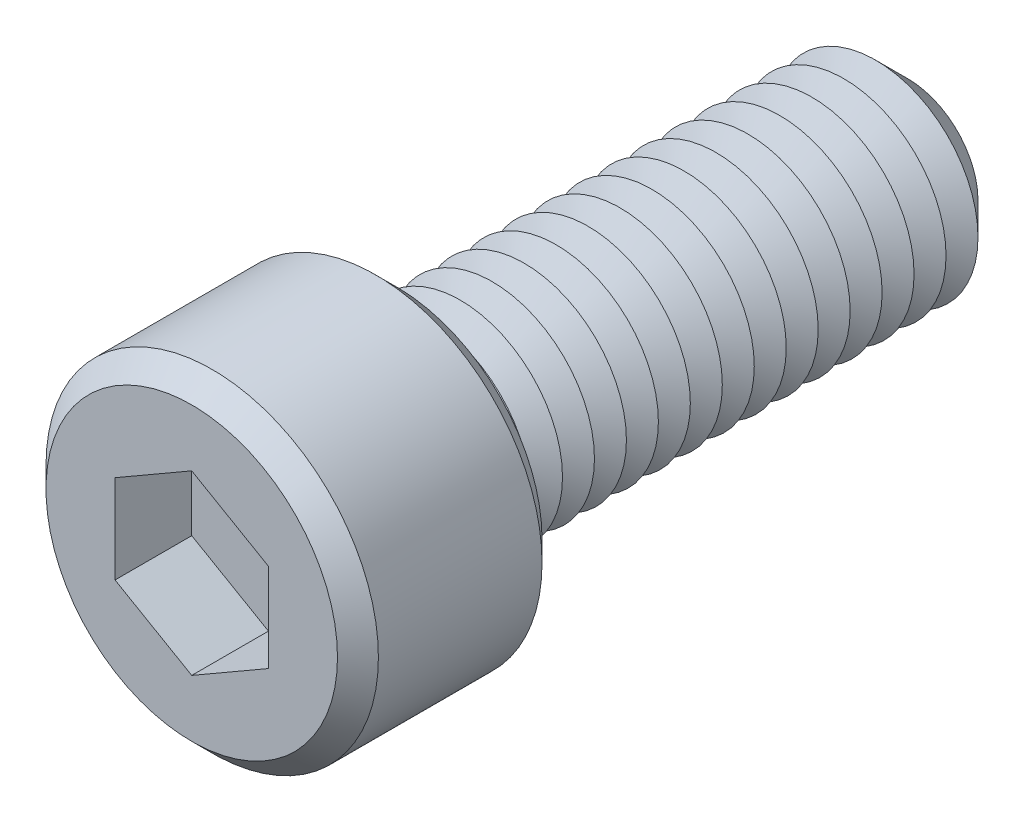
from build123d import *

# Parameters (mm, degrees)
SKETCH1_R           = 6.5
BOSS_EXTRUDE1_DEPTH = 8
SKETCH2_R           = 4
BOSS_EXTRUDE2_DEPTH = 20
CHAMFER1_SIZE       = 1.25
LPATTERN1_COUNT     = 15
LPATTERN1_PITCH     = 1.25
CUT_EXTRUDE1_DEPTH  = 3
SKETCH6_R           = 0.9
CUT_EXTRUDE2_DEPTH  = 25
CHAMFER2_SIZE       = 0.8


with BuildPart() as part:
    # Sketch1 → Boss-Extrude1 (new body)
    with BuildSketch(Plane.XY):
        Circle(SKETCH1_R)
    extrude(amount=BOSS_EXTRUDE1_DEPTH)

    # Sketch2 → Boss-Extrude2 (add)
    with BuildSketch(Plane(origin=(0, 0, 0), x_dir=(-1, 0, 0), z_dir=(0, 0, -1))):
        Circle(SKETCH2_R)
    extrude(amount=BOSS_EXTRUDE2_DEPTH)

    # Chamfer1
    chamfer1_edges = [part.edges().sort_by_distance(p)[0] for p in [
        (4, 0, -20),
    ]]
    chamfer(chamfer1_edges, length=CHAMFER1_SIZE)

    # Sketch4 → Cut-Revolve1 (revolve, cut)
    with BuildSketch(Plane(origin=(0, 0, 0), x_dir=(0, 0, -1), z_dir=(1, 0, 0)), mode=Mode.PRIVATE) as cut_revolve1_sk:
        Polygon((0, 4), (0.625, 2.917468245), (1.25, 4), align=None)
    cut_revolve1 = revolve(cut_revolve1_sk.sketch.rotate(Axis((0, 0, 2.512122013), (0, 0, -1)), 90), axis=Axis((0, 0, 2.512122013), (0, 0, -1)), mode=Mode.SUBTRACT)

    # LPattern1: Cut-Revolve1 ×15
    with Locations(*[(0, 0, -i * LPATTERN1_PITCH) for i in range(1, LPATTERN1_COUNT)]):
        add(cut_revolve1, mode=Mode.SUBTRACT)

    # Sketch5 → Cut-Extrude1 (cut)
    with BuildSketch(Plane.XY.offset(8)):
        Polygon((0, 3.464101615), (-3, 1.732050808), (-3, -1.732050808), (0, -3.464101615), (3, -1.732050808), (3, 1.732050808), align=None)
    extrude(amount=-CUT_EXTRUDE1_DEPTH, mode=Mode.SUBTRACT)

    # Sketch6 → Cut-Extrude2 (cut)
    with BuildSketch(Plane.XY.offset(5)):
        Circle(SKETCH6_R)
    extrude(amount=-CUT_EXTRUDE2_DEPTH, mode=Mode.SUBTRACT)

    # Chamfer2
    chamfer2_edges = [part.edges().sort_by_distance(p)[0] for p in [
        (-6.5, 0, 0),
        (-6.5, 0, 8),
    ]]
    chamfer(chamfer2_edges, length=CHAMFER2_SIZE)


solid = part.part
